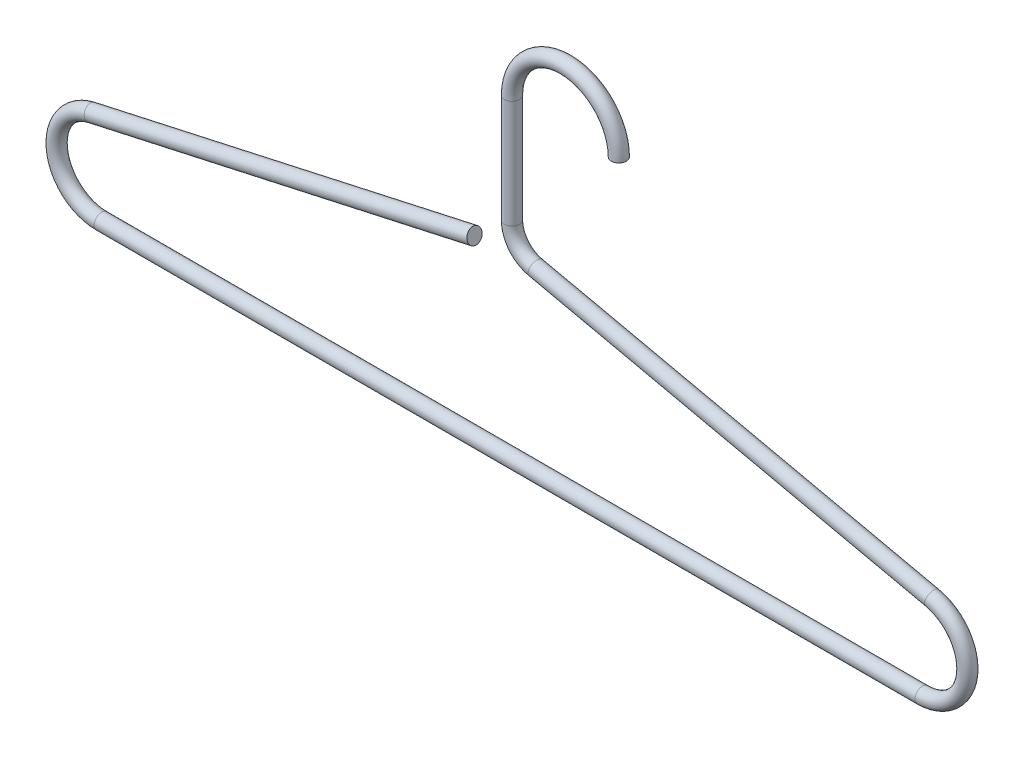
ISO-10303-21;
HEADER;
FILE_DESCRIPTION(('STEP AP214'),'2;1');
FILE_NAME('part.step','',(''),(''),'','','');
FILE_SCHEMA(('AUTOMOTIVE_DESIGN { 1 0 10303 214 1 1 1 1 }'));
ENDSEC;
DATA;
#1=APPLICATION_CONTEXT('core data for automotive mechanical design processes');
#2=APPLICATION_PROTOCOL_DEFINITION('international standard','automotive_design',2000,#1);
#3=PRODUCT_CONTEXT('',#1,'mechanical');
#4=PRODUCT('Part','Part','',(#3));
#5=PRODUCT_RELATED_PRODUCT_CATEGORY('part','',(#4));
#6=PRODUCT_DEFINITION_FORMATION('','',#4);
#7=PRODUCT_DEFINITION_CONTEXT('part definition',#1,'design');
#8=PRODUCT_DEFINITION('design','',#6,#7);
#9=PRODUCT_DEFINITION_SHAPE('','',#8);
#10=(LENGTH_UNIT() NAMED_UNIT(*) SI_UNIT(.MILLI.,.METRE.));
#11=(NAMED_UNIT(*) PLANE_ANGLE_UNIT() SI_UNIT($,.RADIAN.));
#12=(NAMED_UNIT(*) SI_UNIT($,.STERADIAN.) SOLID_ANGLE_UNIT());
#13=UNCERTAINTY_MEASURE_WITH_UNIT(LENGTH_MEASURE(1.E-05),#10,'distance_accuracy_value','');
#14=(GEOMETRIC_REPRESENTATION_CONTEXT(3) GLOBAL_UNCERTAINTY_ASSIGNED_CONTEXT((#13)) GLOBAL_UNIT_ASSIGNED_CONTEXT((#10,
#11,#12)) REPRESENTATION_CONTEXT('',''));
#15=CARTESIAN_POINT('',(0.,0.,0.));
#16=DIRECTION('',(0.,0.,1.));
#17=DIRECTION('',(1.,0.,0.));
#18=AXIS2_PLACEMENT_3D('',#15,#16,#17);
#19=CARTESIAN_POINT('',(22.6085032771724,55.1091565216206,0.));
#20=DIRECTION('',(0.,0.,-1.));
#21=DIRECTION('',(-1.,0.,0.));
#22=AXIS2_PLACEMENT_3D('',#19,#20,#21);
#23=TOROIDAL_SURFACE('',#22,22.6085032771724,3.175);
#24=CARTESIAN_POINT('',(0.,55.1091565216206,0.));
#25=DIRECTION('',(0.,-1.,0.));
#26=DIRECTION('',(1.,0.,0.));
#27=AXIS2_PLACEMENT_3D('',#24,#25,#26);
#28=CIRCLE('',#27,3.175);
#29=CARTESIAN_POINT('',(-3.17499999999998,55.1091565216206,0.));
#30=VERTEX_POINT('',#29);
#31=EDGE_CURVE('E28',#30,#30,#28,.T.);
#32=CARTESIAN_POINT('',(45.2170065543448,55.1091565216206,0.));
#33=DIRECTION('',(0.,1.,0.));
#34=DIRECTION('',(-1.,0.,0.));
#35=AXIS2_PLACEMENT_3D('',#32,#33,#34);
#36=CIRCLE('',#35,3.175);
#37=CARTESIAN_POINT('',(48.3920065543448,55.1091565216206,0.));
#38=VERTEX_POINT('',#37);
#39=EDGE_CURVE('E10',#38,#38,#36,.T.);
#40=CARTESIAN_POINT('',(22.6085032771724,55.1091565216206,0.));
#41=DIRECTION('',(0.,0.,-1.));
#42=DIRECTION('',(-1.,0.,0.));
#43=AXIS2_PLACEMENT_3D('',#40,#41,#42);
#44=CIRCLE('',#43,25.7835032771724);
#45=EDGE_CURVE('',#30,#38,#44,.T.);
#46=ORIENTED_EDGE('',*,*,#31,.F.);
#47=ORIENTED_EDGE('',*,*,#39,.T.);
#48=ORIENTED_EDGE('',*,*,#45,.T.);
#49=ORIENTED_EDGE('',*,*,#45,.F.);
#50=EDGE_LOOP('',(#46,#48,#47,#49));
#51=FACE_BOUND('',#50,.T.);
#52=ADVANCED_FACE('F22',(#51),#23,.T.);
#53=CARTESIAN_POINT('',(0.,9.39842947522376,0.));
#54=DIRECTION('',(0.,1.,0.));
#55=DIRECTION('',(-1.,0.,0.));
#56=AXIS2_PLACEMENT_3D('',#53,#54,#55);
#57=CYLINDRICAL_SURFACE('',#56,3.175);
#58=CARTESIAN_POINT('',(0.,9.39842947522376,0.));
#59=DIRECTION('',(0.,-1.,0.));
#60=DIRECTION('',(1.,0.,0.));
#61=AXIS2_PLACEMENT_3D('',#58,#59,#60);
#62=CIRCLE('',#61,3.175);
#63=CARTESIAN_POINT('',(-3.17499999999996,9.39842947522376,0.));
#64=VERTEX_POINT('',#63);
#65=EDGE_CURVE('E32',#64,#64,#62,.T.);
#66=ORIENTED_EDGE('',*,*,#65,.F.);
#67=EDGE_LOOP('',(#66));
#68=FACE_BOUND('',#67,.T.);
#69=ORIENTED_EDGE('',*,*,#31,.T.);
#70=EDGE_LOOP('',(#69));
#71=FACE_BOUND('',#70,.T.);
#72=ADVANCED_FACE('F75',(#68,#71),#57,.T.);
#73=CARTESIAN_POINT('',(12.7,9.39842947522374,0.));
#74=DIRECTION('',(0.,0.,-1.));
#75=DIRECTION('',(-1.,0.,0.));
#76=AXIS2_PLACEMENT_3D('',#73,#74,#75);
#77=TOROIDAL_SURFACE('',#76,12.7,3.175);
#78=CARTESIAN_POINT('',(9.95719189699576,-3.0018529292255,0.));
#79=DIRECTION('',(0.976400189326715,-0.215969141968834,0.));
#80=DIRECTION('',(0.215969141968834,0.976400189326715,0.));
#81=AXIS2_PLACEMENT_3D('',#78,#79,#80);
#82=CIRCLE('',#81,3.175);
#83=CARTESIAN_POINT('',(9.27148987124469,-6.10192353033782,0.));
#84=VERTEX_POINT('',#83);
#85=EDGE_CURVE('E36',#84,#84,#82,.T.);
#86=CARTESIAN_POINT('',(12.7,9.39842947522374,0.));
#87=DIRECTION('',(0.,0.,-1.));
#88=DIRECTION('',(-1.,0.,0.));
#89=AXIS2_PLACEMENT_3D('',#86,#87,#88);
#90=CIRCLE('',#89,15.875);
#91=EDGE_CURVE('',#84,#64,#90,.T.);
#92=ORIENTED_EDGE('',*,*,#85,.F.);
#93=ORIENTED_EDGE('',*,*,#65,.T.);
#94=ORIENTED_EDGE('',*,*,#91,.T.);
#95=ORIENTED_EDGE('',*,*,#91,.F.);
#96=EDGE_LOOP('',(#92,#94,#93,#95));
#97=FACE_BOUND('',#96,.T.);
#98=ADVANCED_FACE('F80',(#97),#77,.T.);
#99=CARTESIAN_POINT('',(177.807440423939,-40.1285091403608,0.));
#100=DIRECTION('',(-0.976400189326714,0.215969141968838,0.));
#101=DIRECTION('',(-0.215969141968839,-0.976400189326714,0.));
#102=AXIS2_PLACEMENT_3D('',#99,#100,#101);
#103=CYLINDRICAL_SURFACE('',#102,3.175);
#104=CARTESIAN_POINT('',(177.807440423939,-40.1285091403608,0.));
#105=DIRECTION('',(0.976400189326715,-0.215969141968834,0.));
#106=DIRECTION('',(0.215969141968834,0.976400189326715,0.));
#107=AXIS2_PLACEMENT_3D('',#104,#105,#106);
#108=CIRCLE('',#107,3.175);
#109=CARTESIAN_POINT('',(178.493142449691,-37.0284385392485,0.));
#110=VERTEX_POINT('',#109);
#111=EDGE_CURVE('E41',#110,#110,#108,.T.);
#112=ORIENTED_EDGE('',*,*,#111,.F.);
#113=EDGE_LOOP('',(#112));
#114=FACE_BOUND('',#113,.T.);
#115=ORIENTED_EDGE('',*,*,#85,.T.);
#116=EDGE_LOOP('',(#115));
#117=FACE_BOUND('',#116,.T.);
#118=ADVANCED_FACE('F85',(#114,#117),#103,.T.);
#119=CARTESIAN_POINT('',(173.693228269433,-58.7289327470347,0.));
#120=DIRECTION('',(0.,0.,1.));
#121=DIRECTION('',(1.,0.,0.));
#122=AXIS2_PLACEMENT_3D('',#119,#120,#121);
#123=TOROIDAL_SURFACE('',#122,19.05,3.175);
#124=CARTESIAN_POINT('',(173.693228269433,-77.7789327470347,0.));
#125=DIRECTION('',(-1.,0.,0.));
#126=DIRECTION('',(0.,-1.,0.));
#127=AXIS2_PLACEMENT_3D('',#124,#125,#126);
#128=CIRCLE('',#127,3.175);
#129=CARTESIAN_POINT('',(173.693228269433,-80.9539327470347,0.));
#130=VERTEX_POINT('',#129);
#131=EDGE_CURVE('E44',#130,#130,#128,.T.);
#132=CARTESIAN_POINT('',(173.693228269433,-58.7289327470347,0.));
#133=DIRECTION('',(0.,0.,1.));
#134=DIRECTION('',(1.,0.,0.));
#135=AXIS2_PLACEMENT_3D('',#132,#133,#134);
#136=CIRCLE('',#135,22.225);
#137=EDGE_CURVE('',#130,#110,#136,.T.);
#138=ORIENTED_EDGE('',*,*,#131,.F.);
#139=ORIENTED_EDGE('',*,*,#111,.T.);
#140=ORIENTED_EDGE('',*,*,#137,.T.);
#141=ORIENTED_EDGE('',*,*,#137,.F.);
#142=EDGE_LOOP('',(#138,#140,#139,#141));
#143=FACE_BOUND('',#142,.T.);
#144=ADVANCED_FACE('F92',(#143),#123,.T.);
#145=CARTESIAN_POINT('',(-173.693228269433,-77.7789327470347,0.));
#146=DIRECTION('',(1.,0.,0.));
#147=DIRECTION('',(0.,0.,-1.));
#148=AXIS2_PLACEMENT_3D('',#145,#146,#147);
#149=CYLINDRICAL_SURFACE('',#148,3.175);
#150=CARTESIAN_POINT('',(-173.693228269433,-77.7789327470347,0.));
#151=DIRECTION('',(-1.,0.,0.));
#152=DIRECTION('',(0.,-1.,0.));
#153=AXIS2_PLACEMENT_3D('',#150,#151,#152);
#154=CIRCLE('',#153,3.175);
#155=CARTESIAN_POINT('',(-173.693228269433,-80.9539327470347,0.));
#156=VERTEX_POINT('',#155);
#157=EDGE_CURVE('E47',#156,#156,#154,.T.);
#158=ORIENTED_EDGE('',*,*,#157,.F.);
#159=EDGE_LOOP('',(#158));
#160=FACE_BOUND('',#159,.T.);
#161=ORIENTED_EDGE('',*,*,#131,.T.);
#162=EDGE_LOOP('',(#161));
#163=FACE_BOUND('',#162,.T.);
#164=ADVANCED_FACE('F71',(#160,#163),#149,.T.);
#165=CARTESIAN_POINT('',(-173.693228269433,-58.7289327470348,0.));
#166=DIRECTION('',(0.,0.,1.));
#167=DIRECTION('',(1.,0.,0.));
#168=AXIS2_PLACEMENT_3D('',#165,#166,#167);
#169=TOROIDAL_SURFACE('',#168,19.05,3.175);
#170=CARTESIAN_POINT('',(-177.807440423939,-40.1285091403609,0.));
#171=DIRECTION('',(0.976400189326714,0.215969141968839,0.));
#172=DIRECTION('',(-0.215969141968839,0.976400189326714,0.));
#173=AXIS2_PLACEMENT_3D('',#170,#171,#172);
#174=CIRCLE('',#173,3.175);
#175=CARTESIAN_POINT('',(-178.493142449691,-37.0284385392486,0.));
#176=VERTEX_POINT('',#175);
#177=EDGE_CURVE('E50',#176,#176,#174,.T.);
#178=CARTESIAN_POINT('',(-173.693228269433,-58.7289327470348,0.));
#179=DIRECTION('',(0.,0.,1.));
#180=DIRECTION('',(1.,0.,0.));
#181=AXIS2_PLACEMENT_3D('',#178,#179,#180);
#182=CIRCLE('',#181,22.225);
#183=EDGE_CURVE('',#176,#156,#182,.T.);
#184=ORIENTED_EDGE('',*,*,#177,.F.);
#185=ORIENTED_EDGE('',*,*,#157,.T.);
#186=ORIENTED_EDGE('',*,*,#183,.T.);
#187=ORIENTED_EDGE('',*,*,#183,.F.);
#188=EDGE_LOOP('',(#184,#186,#185,#187));
#189=FACE_BOUND('',#188,.T.);
#190=ADVANCED_FACE('F62',(#189),#169,.T.);
#191=CARTESIAN_POINT('',(-177.807440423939,-40.1285091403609,0.));
#192=DIRECTION('',(0.976400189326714,0.215969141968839,0.));
#193=DIRECTION('',(-0.215969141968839,0.976400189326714,0.));
#194=AXIS2_PLACEMENT_3D('',#191,#192,#193);
#195=CYLINDRICAL_SURFACE('',#194,3.175);
#196=ORIENTED_EDGE('',*,*,#177,.T.);
#197=EDGE_LOOP('',(#196));
#198=FACE_BOUND('',#197,.T.);
#199=CARTESIAN_POINT('',(-15.8778291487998,-4.31143373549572,0.));
#200=DIRECTION('',(0.976400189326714,0.215969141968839,0.));
#201=DIRECTION('',(-0.215969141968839,0.976400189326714,0.));
#202=AXIS2_PLACEMENT_3D('',#199,#200,#201);
#203=CIRCLE('',#202,3.175);
#204=CARTESIAN_POINT('',(-16.5635311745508,-1.21136313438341,0.));
#205=VERTEX_POINT('',#204);
#206=EDGE_CURVE('E53',#205,#205,#203,.T.);
#207=ORIENTED_EDGE('',*,*,#206,.F.);
#208=EDGE_LOOP('',(#207));
#209=FACE_BOUND('',#208,.T.);
#210=ADVANCED_FACE('F59',(#198,#209),#195,.T.);
#211=CARTESIAN_POINT('',(45.2170065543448,55.1091565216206,0.));
#212=DIRECTION('',(0.,1.,0.));
#213=DIRECTION('',(-1.,0.,0.));
#214=AXIS2_PLACEMENT_3D('',#211,#212,#213);
#215=PLANE('',#214);
#216=ORIENTED_EDGE('',*,*,#39,.F.);
#217=EDGE_LOOP('',(#216));
#218=FACE_BOUND('',#217,.T.);
#219=ADVANCED_FACE('F61',(#218),#215,.F.);
#220=CARTESIAN_POINT('',(-15.8778291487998,-4.31143373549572,0.));
#221=DIRECTION('',(0.976400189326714,0.215969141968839,0.));
#222=DIRECTION('',(-0.215969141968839,0.976400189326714,0.));
#223=AXIS2_PLACEMENT_3D('',#220,#221,#222);
#224=PLANE('',#223);
#225=ORIENTED_EDGE('',*,*,#206,.T.);
#226=EDGE_LOOP('',(#225));
#227=FACE_BOUND('',#226,.T.);
#228=ADVANCED_FACE('F57',(#227),#224,.T.);
#229=CLOSED_SHELL('',(#52,#72,#98,#118,#144,#164,#190,#210,#219,#228));
#230=MANIFOLD_SOLID_BREP('B2',#229);
#231=ADVANCED_BREP_SHAPE_REPRESENTATION('',(#18,#230),#14);
#232=SHAPE_DEFINITION_REPRESENTATION(#9,#231);
ENDSEC;
END-ISO-10303-21;
